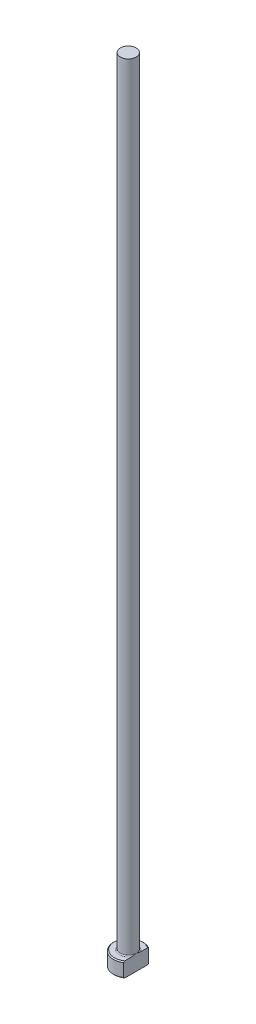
from build123d import *
from build123d.topology import SkipClean

# Parameters (mm, degrees)
CHAMFER1_SIZE = 0.2
FILLET1_R     = 0.2
KEY_DEPTH     = 161.056240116


with BuildPart() as part:
    # Sketch1 → Revolve1 (revolve)
    with BuildSketch(Plane.XY, mode=Mode.PRIVATE) as revolve1_sk:
        Polygon((0, 0), (-3, 0), (-3, 3), (-1.6, 3), (-1.6, 160), (0, 160), align=None)
    revolve(revolve1_sk.sketch.rotate(Axis((0, 259.958771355, 0), (0, -1, 0)), 270), axis=Axis((0, 259.958771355, 0), (0, -1, 0)))

    # Chamfer1
    chamfer1_edges = [part.edges().sort_by_distance(p)[0] for p in [
        (0, 3, -3),
        (0, 0, -3),
    ]]
    chamfer(chamfer1_edges, length=CHAMFER1_SIZE)

    # Fillet1
    fillet1_edges = [part.edges().sort_by_distance(p)[0] for p in [
        (0, 3, -1.6),
    ]]
    fillet(fillet1_edges, radius=FILLET1_R)

    # Sketch2 → KEY (cut, through all)
    with SkipClean():  # the faces are left unmerged after this step: merging them gives an invalid solid
        with BuildSketch(Plane(origin=(0, 0, 0), x_dir=(1, 0, 0), z_dir=(0, 1, 0))):
            with BuildLine():
                Line((1.6, 2.537715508), (1.6, -2.537715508))
                ThreePointArc((1.6, -2.537715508), (3, 0), (1.6, 2.537715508))
            make_face()
        extrude(amount=KEY_DEPTH, mode=Mode.SUBTRACT)


solid = part.part
